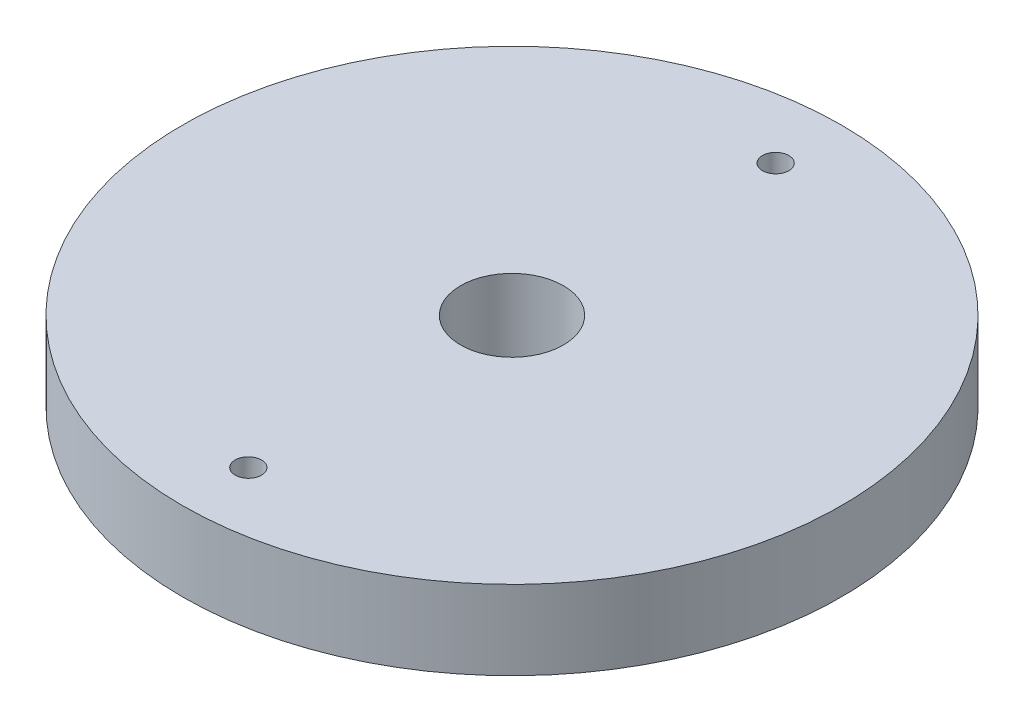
from build123d import *

# Parameters (mm, degrees)
SKETCH1_R           = 12.5
BOSS_EXTRUDE1_DEPTH = 3
CUT_EXTRUDE1_REACH  = 19.93
SKETCH2_R           = 1.95
SKETCH2_R_2         = 0.5


with BuildPart() as part:
    # Sketch1 → Boss-Extrude1 (new body)
    with BuildSketch(Plane(origin=(0, 0, 0), x_dir=(1, 0, 0), z_dir=(0, 1, 0))):
        with Locations(Location((0, 0, 0), (0, 0, 270))):
            Circle(SKETCH1_R)
    extrude(amount=BOSS_EXTRUDE1_DEPTH)

    # Sketch2 → Cut-Extrude1 (cut, up to next)
    with BuildSketch(Plane(origin=(0, 0, 0), x_dir=(1, 0, 0), z_dir=(0, 1, 0)), mode=Mode.PRIVATE) as cut_extrude1_sk1:
        with Locations(Location((0, 0, 0), (0, 0, 90))):
            Circle(SKETCH2_R)
    cut_extrude1_tool1 = extrude(cut_extrude1_sk1.sketch, amount=CUT_EXTRUDE1_REACH, mode=Mode.PRIVATE) & part.part
    # Sketch2 → Cut-Extrude1 (cut, up to next)
    with BuildSketch(Plane(origin=(0, 0, 0), x_dir=(1, 0, 0), z_dir=(0, 1, 0)), mode=Mode.PRIVATE) as cut_extrude1_sk2:
        with Locations(Location((0, 10, 0), (0, 0, 270))):
            Circle(SKETCH2_R_2)
    cut_extrude1_tool2 = extrude(cut_extrude1_sk2.sketch, amount=CUT_EXTRUDE1_REACH, mode=Mode.PRIVATE) & part.part
    # Sketch2 → Cut-Extrude1 (cut, up to next)
    with BuildSketch(Plane(origin=(0, 0, 0), x_dir=(1, 0, 0), z_dir=(0, 1, 0)), mode=Mode.PRIVATE) as cut_extrude1_sk3:
        with Locations(Location((0, -10, 0), (0, 0, 90))):
            Circle(SKETCH2_R_2)
    cut_extrude1_tool3 = extrude(cut_extrude1_sk3.sketch, amount=CUT_EXTRUDE1_REACH, mode=Mode.PRIVATE) & part.part
    add(cut_extrude1_tool1.solids().sort_by_distance((0, 0, 0))[0], mode=Mode.SUBTRACT)
    add(cut_extrude1_tool2.solids().sort_by_distance((0, 0, -10))[0], mode=Mode.SUBTRACT)
    add(cut_extrude1_tool3.solids().sort_by_distance((0, 0, 10))[0], mode=Mode.SUBTRACT)


solid = part.part
